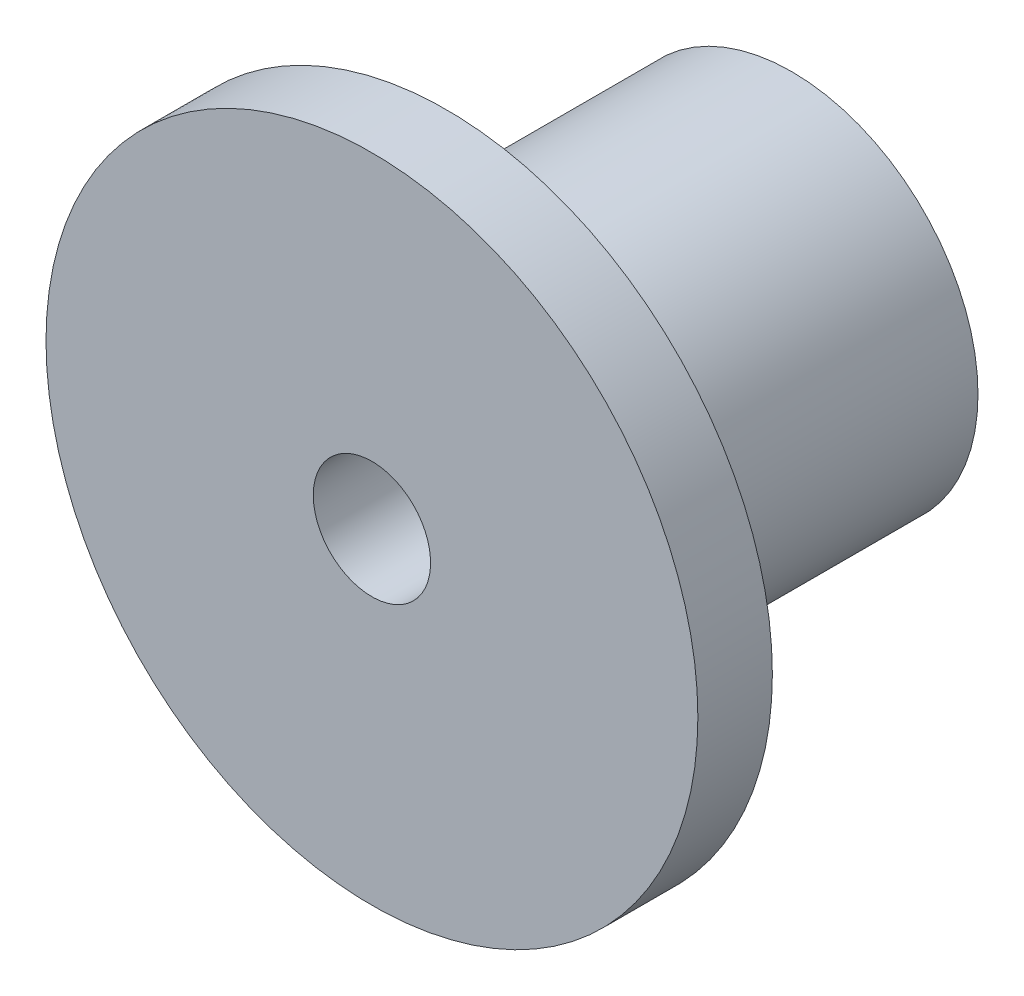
ISO-10303-21;
HEADER;
FILE_DESCRIPTION(('STEP AP214'),'2;1');
FILE_NAME('part.step','',(''),(''),'','','');
FILE_SCHEMA(('AUTOMOTIVE_DESIGN { 1 0 10303 214 1 1 1 1 }'));
ENDSEC;
DATA;
#1=APPLICATION_CONTEXT('core data for automotive mechanical design processes');
#2=APPLICATION_PROTOCOL_DEFINITION('international standard','automotive_design',2000,#1);
#3=PRODUCT_CONTEXT('',#1,'mechanical');
#4=PRODUCT('Part','Part','',(#3));
#5=PRODUCT_RELATED_PRODUCT_CATEGORY('part','',(#4));
#6=PRODUCT_DEFINITION_FORMATION('','',#4);
#7=PRODUCT_DEFINITION_CONTEXT('part definition',#1,'design');
#8=PRODUCT_DEFINITION('design','',#6,#7);
#9=PRODUCT_DEFINITION_SHAPE('','',#8);
#10=(LENGTH_UNIT() NAMED_UNIT(*) SI_UNIT(.MILLI.,.METRE.));
#11=(NAMED_UNIT(*) PLANE_ANGLE_UNIT() SI_UNIT($,.RADIAN.));
#12=(NAMED_UNIT(*) SI_UNIT($,.STERADIAN.) SOLID_ANGLE_UNIT());
#13=UNCERTAINTY_MEASURE_WITH_UNIT(LENGTH_MEASURE(1.E-05),#10,'distance_accuracy_value','');
#14=(GEOMETRIC_REPRESENTATION_CONTEXT(3) GLOBAL_UNCERTAINTY_ASSIGNED_CONTEXT((#13)) GLOBAL_UNIT_ASSIGNED_CONTEXT((#10,
#11,#12)) REPRESENTATION_CONTEXT('',''));
#15=CARTESIAN_POINT('',(0.,0.,0.));
#16=DIRECTION('',(0.,0.,1.));
#17=DIRECTION('',(1.,0.,0.));
#18=AXIS2_PLACEMENT_3D('',#15,#16,#17);
#19=CARTESIAN_POINT('',(0.,0.,2.54));
#20=DIRECTION('',(0.,0.,-1.));
#21=DIRECTION('',(-1.,0.,0.));
#22=AXIS2_PLACEMENT_3D('',#19,#20,#21);
#23=CYLINDRICAL_SURFACE('',#22,11.1125);
#24=CARTESIAN_POINT('',(0.,0.,2.54));
#25=DIRECTION('',(0.,0.,1.));
#26=DIRECTION('',(1.,0.,0.));
#27=AXIS2_PLACEMENT_3D('',#24,#25,#26);
#28=CIRCLE('',#27,11.1125);
#29=CARTESIAN_POINT('',(11.1125,0.,2.54));
#30=VERTEX_POINT('',#29);
#31=EDGE_CURVE('E10',#30,#30,#28,.T.);
#32=ORIENTED_EDGE('',*,*,#31,.F.);
#33=EDGE_LOOP('',(#32));
#34=FACE_BOUND('',#33,.T.);
#35=CARTESIAN_POINT('',(0.,0.,0.));
#36=DIRECTION('',(0.,0.,1.));
#37=DIRECTION('',(1.,0.,0.));
#38=AXIS2_PLACEMENT_3D('',#35,#36,#37);
#39=CIRCLE('',#38,11.1125);
#40=CARTESIAN_POINT('',(11.1125,0.,0.));
#41=VERTEX_POINT('',#40);
#42=EDGE_CURVE('E36',#41,#41,#39,.T.);
#43=ORIENTED_EDGE('',*,*,#42,.T.);
#44=EDGE_LOOP('',(#43));
#45=FACE_BOUND('',#44,.T.);
#46=ADVANCED_FACE('F29',(#34,#45),#23,.T.);
#47=CARTESIAN_POINT('',(0.,0.,2.54));
#48=DIRECTION('',(0.,0.,1.));
#49=DIRECTION('',(1.,0.,0.));
#50=AXIS2_PLACEMENT_3D('',#47,#48,#49);
#51=PLANE('',#50);
#52=CARTESIAN_POINT('',(0.,0.,2.54));
#53=DIRECTION('',(0.,0.,-1.));
#54=DIRECTION('',(-1.,0.,0.));
#55=AXIS2_PLACEMENT_3D('',#52,#53,#54);
#56=CIRCLE('',#55,2.);
#57=CARTESIAN_POINT('',(-2.,0.,2.54));
#58=VERTEX_POINT('',#57);
#59=EDGE_CURVE('E45',#58,#58,#56,.T.);
#60=ORIENTED_EDGE('',*,*,#59,.T.);
#61=EDGE_LOOP('',(#60));
#62=FACE_BOUND('',#61,.T.);
#63=ORIENTED_EDGE('',*,*,#31,.T.);
#64=EDGE_LOOP('',(#63));
#65=FACE_BOUND('',#64,.T.);
#66=ADVANCED_FACE('F52',(#62,#65),#51,.T.);
#67=CARTESIAN_POINT('',(0.,0.,0.));
#68=DIRECTION('',(0.,0.,1.));
#69=DIRECTION('',(1.,0.,0.));
#70=AXIS2_PLACEMENT_3D('',#67,#68,#69);
#71=PLANE('',#70);
#72=CARTESIAN_POINT('',(0.,0.,0.));
#73=DIRECTION('',(0.,0.,1.));
#74=DIRECTION('',(1.,0.,0.));
#75=AXIS2_PLACEMENT_3D('',#72,#73,#74);
#76=CIRCLE('',#75,6.35);
#77=CARTESIAN_POINT('',(6.35,0.,0.));
#78=VERTEX_POINT('',#77);
#79=EDGE_CURVE('E32',#78,#78,#76,.T.);
#80=ORIENTED_EDGE('',*,*,#79,.T.);
#81=EDGE_LOOP('',(#80));
#82=FACE_BOUND('',#81,.T.);
#83=ORIENTED_EDGE('',*,*,#42,.F.);
#84=EDGE_LOOP('',(#83));
#85=FACE_BOUND('',#84,.T.);
#86=ADVANCED_FACE('F69',(#82,#85),#71,.F.);
#87=CARTESIAN_POINT('',(0.,0.,-11.7729));
#88=DIRECTION('',(0.,0.,1.));
#89=DIRECTION('',(1.,0.,0.));
#90=AXIS2_PLACEMENT_3D('',#87,#88,#89);
#91=CYLINDRICAL_SURFACE('',#90,6.35);
#92=CARTESIAN_POINT('',(0.,0.,-11.7729));
#93=DIRECTION('',(0.,0.,1.));
#94=DIRECTION('',(1.,0.,0.));
#95=AXIS2_PLACEMENT_3D('',#92,#93,#94);
#96=CIRCLE('',#95,6.35);
#97=CARTESIAN_POINT('',(6.35,0.,-11.7729));
#98=VERTEX_POINT('',#97);
#99=EDGE_CURVE('E42',#98,#98,#96,.T.);
#100=ORIENTED_EDGE('',*,*,#99,.T.);
#101=EDGE_LOOP('',(#100));
#102=FACE_BOUND('',#101,.T.);
#103=ORIENTED_EDGE('',*,*,#79,.F.);
#104=EDGE_LOOP('',(#103));
#105=FACE_BOUND('',#104,.T.);
#106=ADVANCED_FACE('F63',(#102,#105),#91,.T.);
#107=CARTESIAN_POINT('',(0.,0.,-11.7729));
#108=DIRECTION('',(0.,0.,1.));
#109=DIRECTION('',(1.,0.,0.));
#110=AXIS2_PLACEMENT_3D('',#107,#108,#109);
#111=PLANE('',#110);
#112=CARTESIAN_POINT('',(0.,0.,-11.7729));
#113=DIRECTION('',(0.,0.,-1.));
#114=DIRECTION('',(-1.,0.,0.));
#115=AXIS2_PLACEMENT_3D('',#112,#113,#114);
#116=CIRCLE('',#115,2.);
#117=CARTESIAN_POINT('',(-2.,0.,-11.7729));
#118=VERTEX_POINT('',#117);
#119=EDGE_CURVE('E46',#118,#118,#116,.T.);
#120=ORIENTED_EDGE('',*,*,#119,.F.);
#121=EDGE_LOOP('',(#120));
#122=FACE_BOUND('',#121,.T.);
#123=ORIENTED_EDGE('',*,*,#99,.F.);
#124=EDGE_LOOP('',(#123));
#125=FACE_BOUND('',#124,.T.);
#126=ADVANCED_FACE('F57',(#122,#125),#111,.F.);
#127=CARTESIAN_POINT('',(0.,0.,2.54));
#128=DIRECTION('',(0.,0.,-1.));
#129=DIRECTION('',(-1.,0.,0.));
#130=AXIS2_PLACEMENT_3D('',#127,#128,#129);
#131=CYLINDRICAL_SURFACE('',#130,2.);
#132=ORIENTED_EDGE('',*,*,#59,.F.);
#133=EDGE_LOOP('',(#132));
#134=FACE_BOUND('',#133,.T.);
#135=ORIENTED_EDGE('',*,*,#119,.T.);
#136=EDGE_LOOP('',(#135));
#137=FACE_BOUND('',#136,.T.);
#138=ADVANCED_FACE('F54',(#134,#137),#131,.F.);
#139=CLOSED_SHELL('',(#46,#66,#86,#106,#126,#138));
#140=MANIFOLD_SOLID_BREP('B2',#139);
#141=ADVANCED_BREP_SHAPE_REPRESENTATION('',(#18,#140),#14);
#142=SHAPE_DEFINITION_REPRESENTATION(#9,#141);
ENDSEC;
END-ISO-10303-21;
